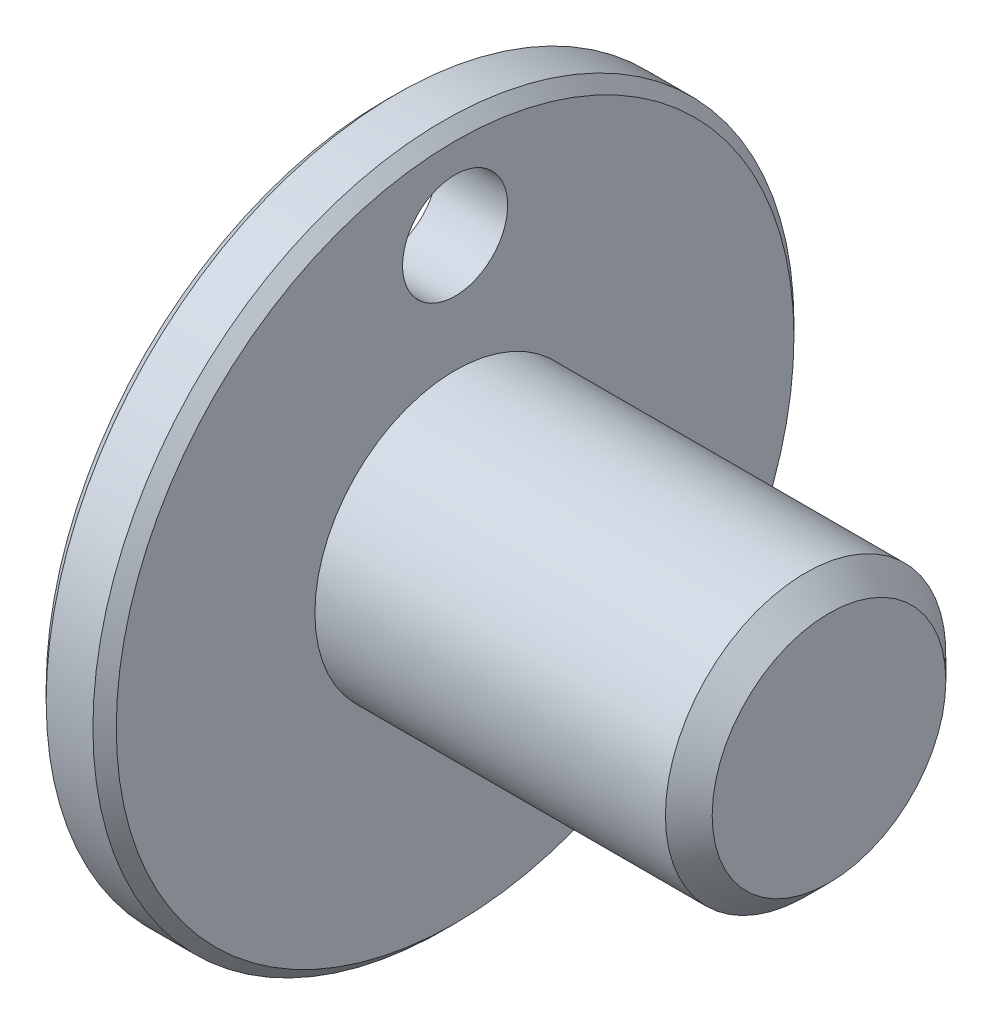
from build123d import *

# Parameters (mm, degrees)
CHANFREIN1_SIZE         = 1
CHANFREIN2_SIZE         = 0.5
ESQUISSE2_R             = 2.25
ENL_V_MAT_EXTRU_1_DEPTH = 29.478061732


with BuildPart() as part:
    # Esquisse1 → Base-R_volution (revolve)
    with BuildSketch(Plane.XY, mode=Mode.PRIVATE) as base_r_volution_sk:
        Polygon((-3, 0), (-3, 15), (0, 15), (0, 6), (16, 6), (16, 0), align=None)
    revolve(base_r_volution_sk.sketch.rotate(Axis((-27.336707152, 0, 0), (1, 0, 0)), 90), axis=Axis((-27.336707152, 0, 0), (1, 0, 0)))

    # Chanfrein1
    chanfrein1_edges = [part.edges().sort_by_distance(p)[0] for p in [
        (16, 0, -6),
    ]]
    chamfer(chanfrein1_edges, length=CHANFREIN1_SIZE)

    # Chanfrein2
    chanfrein2_edges = [part.edges().sort_by_distance(p)[0] for p in [
        (0, 0, -15),
        (-3, 0, -15),
    ]]
    chamfer(chanfrein2_edges, length=CHANFREIN2_SIZE)

    # Esquisse2 → Enl_v. mat.-Extru.1 (cut, through all)
    with BuildSketch(Plane.ZY.offset(3)):
        with Locations((0, 11)):
            Circle(ESQUISSE2_R)
    extrude(amount=-ENL_V_MAT_EXTRU_1_DEPTH, mode=Mode.SUBTRACT)


solid = part.part
